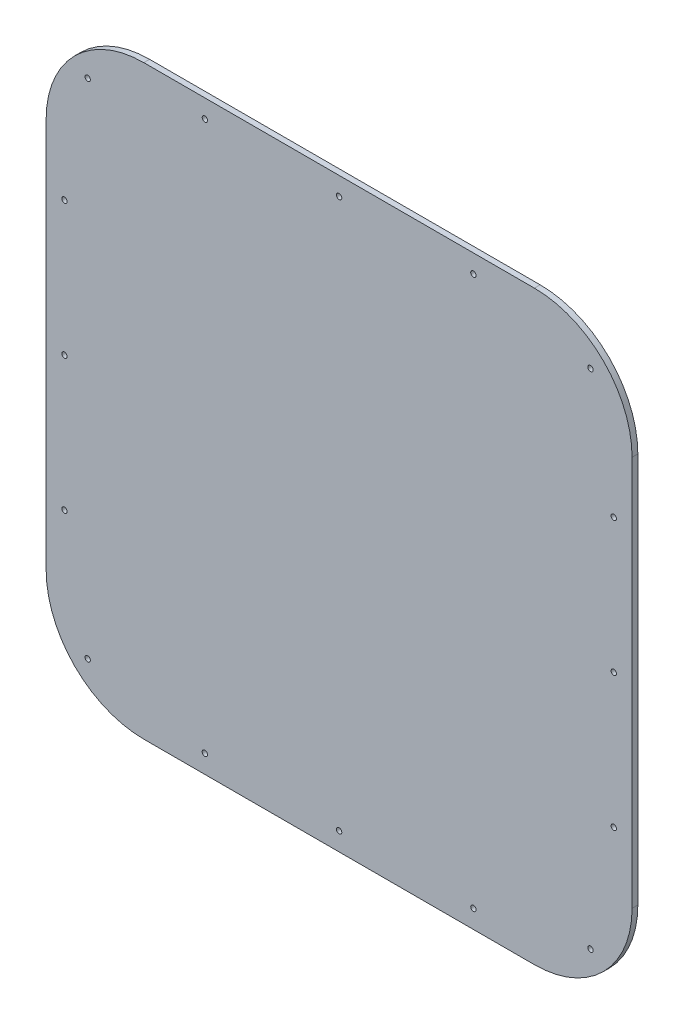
from build123d import *

# Parameters (mm, degrees)
SKETCH1_R           = 2.778125
BOSS_EXTRUDE1_DEPTH = 6


with BuildPart() as part:
    # Sketch1 → Boss-Extrude1 (new body)
    with BuildSketch(Plane.XY):
        with BuildLine():
            Line((-203.2, 304.8), (203.2, 304.8))
            ThreePointArc((203.2, 304.8), (275.042048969, 275.042048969), (304.8, 203.2))
            Line((304.8, 203.2), (304.8, -203.2))
            ThreePointArc((304.8, -203.2), (275.042048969, -275.042048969), (203.2, -304.8))
            Line((203.2, -304.8), (-203.2, -304.8))
            ThreePointArc((-203.2, -304.8), (-275.042048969, -275.042048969), (-304.8, -203.2))
            Line((-304.8, -203.2), (-304.8, 203.2))
            ThreePointArc((-304.8, 203.2), (-275.042048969, 275.042048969), (-203.2, 304.8))
        make_face()
        with Locations((0, 285.75)):
            Circle(SKETCH1_R, mode=Mode.SUBTRACT)
        with Locations((0, -285.75)):
            Circle(SKETCH1_R, mode=Mode.SUBTRACT)
        with Locations((-285.75, 0)):
            Circle(SKETCH1_R, mode=Mode.SUBTRACT)
        with Locations((285.75, 0)):
            Circle(SKETCH1_R, mode=Mode.SUBTRACT)
        with Locations((-261.571664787, 261.571664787)):
            Circle(SKETCH1_R, mode=Mode.SUBTRACT)
        with Locations((261.571664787, 261.571664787)):
            Circle(SKETCH1_R, mode=Mode.SUBTRACT)
        with Locations((261.571664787, -261.571664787)):
            Circle(SKETCH1_R, mode=Mode.SUBTRACT)
        with Locations((-261.571664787, -261.571664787)):
            Circle(SKETCH1_R, mode=Mode.SUBTRACT)
        with Locations((-139.7, 285.75)):
            Circle(SKETCH1_R, mode=Mode.SUBTRACT)
        with Locations((139.7, 285.75)):
            Circle(SKETCH1_R, mode=Mode.SUBTRACT)
        with Locations((-139.7, -285.75)):
            Circle(SKETCH1_R, mode=Mode.SUBTRACT)
        with Locations((139.7, -285.75)):
            Circle(SKETCH1_R, mode=Mode.SUBTRACT)
        with Locations((-285.75, 139.7)):
            Circle(SKETCH1_R, mode=Mode.SUBTRACT)
        with Locations((-285.75, -139.7)):
            Circle(SKETCH1_R, mode=Mode.SUBTRACT)
        with Locations((285.75, -139.7)):
            Circle(SKETCH1_R, mode=Mode.SUBTRACT)
        with Locations((285.75, 139.7)):
            Circle(SKETCH1_R, mode=Mode.SUBTRACT)
    extrude(amount=BOSS_EXTRUDE1_DEPTH)


solid = part.part
